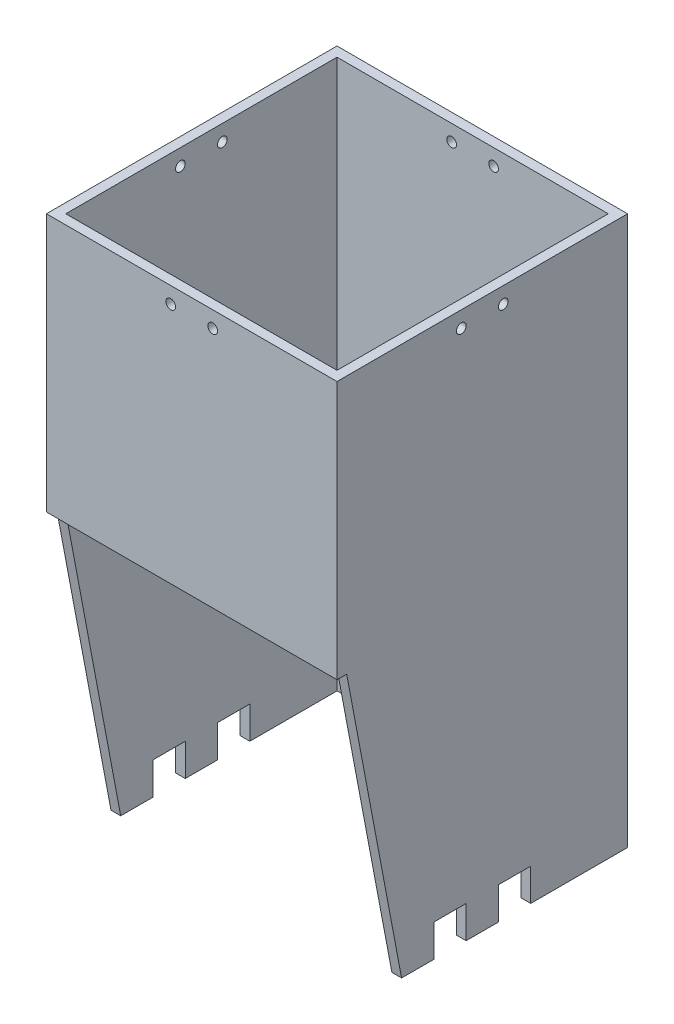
from build123d import *

# Parameters (mm, degrees)
SKETCH_1_W          = 90
SKETCH_1_H          = 90
SKETCH_1_W_2        = 84
SKETCH_1_H_2        = 84
EXTRUDE_1_DEPTH     = 170
CUT_EXTRUDE_1_REACH = 199.547
SKETCH_2_R          = 1.5
CUT_EXTRUDE_2_REACH = 199.547
SKETCH_3_R          = 1.5
CUT_EXTRUDE_3_REACH = 199.547
SKETCH_4_W          = 10
SKETCH_4_H          = 10
CUT_EXTRUDE_4_REACH = 199.547


with BuildPart() as part:
    # Sketch 1 → Extrude 1 (new body)
    with BuildSketch(Plane(origin=(0, 0, 0), x_dir=(1, 0, 0), z_dir=(0, 1, 0))):
        Rectangle(SKETCH_1_W, SKETCH_1_H)
        Rectangle(SKETCH_1_W_2, SKETCH_1_H_2, mode=Mode.SUBTRACT)
    extrude(amount=EXTRUDE_1_DEPTH)

    # Cut-Extrude 1: up to this face of the body (flat: up to its plane)
    cut_extrude_1_end = Plane(part.part.faces().sort_by_distance((0, 85, -45))[0])
    # Sketch 2 → Cut-Extrude 1 (cut, up to the picked face)
    with BuildSketch(Plane.XY.offset(45), mode=Mode.PRIVATE) as cut_extrude_1_sk1:
        with Locations((6.5, 165)):
            Circle(SKETCH_2_R)
    cut_extrude_1_tool1 = split(extrude(cut_extrude_1_sk1.sketch, amount=-CUT_EXTRUDE_1_REACH, mode=Mode.PRIVATE), bisect_by=cut_extrude_1_end, keep=Keep.BOTH, mode=Mode.PRIVATE)
    # Sketch 2 → Cut-Extrude 1 (cut, up to the picked face)
    with BuildSketch(Plane.XY.offset(45), mode=Mode.PRIVATE) as cut_extrude_1_sk2:
        with Locations((-6.5, 165)):
            Circle(SKETCH_2_R)
    cut_extrude_1_tool2 = split(extrude(cut_extrude_1_sk2.sketch, amount=-CUT_EXTRUDE_1_REACH, mode=Mode.PRIVATE), bisect_by=cut_extrude_1_end, keep=Keep.BOTH, mode=Mode.PRIVATE)
    add(cut_extrude_1_tool1.solids().sort_by(Axis((6.5, 165, 45), (0, 0, -1)))[0], mode=Mode.SUBTRACT)
    add(cut_extrude_1_tool2.solids().sort_by(Axis((-6.5, 165, 45), (0, 0, -1)))[0], mode=Mode.SUBTRACT)

    # Cut-Extrude 2: up to this face of the body (flat: up to its plane)
    cut_extrude_2_end = Plane(part.part.faces().sort_by_distance((-45, 85, 0))[0])
    # Sketch 3 → Cut-Extrude 2 (cut, up to the picked face)
    with BuildSketch(Plane(origin=(45, 0, 0), x_dir=(0, 0, -1), z_dir=(1, 0, 0)), mode=Mode.PRIVATE) as cut_extrude_2_sk1:
        with Locations((6.5, 165)):
            Circle(SKETCH_3_R)
    cut_extrude_2_tool1 = split(extrude(cut_extrude_2_sk1.sketch, amount=-CUT_EXTRUDE_2_REACH, mode=Mode.PRIVATE), bisect_by=cut_extrude_2_end, keep=Keep.BOTH, mode=Mode.PRIVATE)
    # Sketch 3 → Cut-Extrude 2 (cut, up to the picked face)
    with BuildSketch(Plane(origin=(45, 0, 0), x_dir=(0, 0, -1), z_dir=(1, 0, 0)), mode=Mode.PRIVATE) as cut_extrude_2_sk2:
        with Locations((-6.5, 165)):
            Circle(SKETCH_3_R)
    cut_extrude_2_tool2 = split(extrude(cut_extrude_2_sk2.sketch, amount=-CUT_EXTRUDE_2_REACH, mode=Mode.PRIVATE), bisect_by=cut_extrude_2_end, keep=Keep.BOTH, mode=Mode.PRIVATE)
    add(cut_extrude_2_tool1.solids().sort_by(Axis((45, 165, -6.5), (-1, 0, 0)))[0], mode=Mode.SUBTRACT)
    add(cut_extrude_2_tool2.solids().sort_by(Axis((45, 165, 6.5), (-1, 0, 0)))[0], mode=Mode.SUBTRACT)

    # Cut-Extrude 3: up to this face of the body (flat: up to its plane)
    cut_extrude_3_end = Plane(part.part.faces().sort_by_distance((-45, 84.926011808, 0))[0])
    # Sketch 4 → Cut-Extrude 3 (cut, up to the picked face)
    with BuildSketch(Plane(origin=(45, 0, 0), x_dir=(0, 0, -1), z_dir=(1, 0, 0)), mode=Mode.PRIVATE) as cut_extrude_3_sk1:
        with Locations((10, 5)):
            Rectangle(SKETCH_4_W, SKETCH_4_H)
    cut_extrude_3_tool1 = split(extrude(cut_extrude_3_sk1.sketch, amount=-CUT_EXTRUDE_3_REACH, mode=Mode.PRIVATE), bisect_by=cut_extrude_3_end, keep=Keep.BOTH, mode=Mode.PRIVATE)
    # Sketch 4 → Cut-Extrude 3 (cut, up to the picked face)
    with BuildSketch(Plane(origin=(45, 0, 0), x_dir=(0, 0, -1), z_dir=(1, 0, 0)), mode=Mode.PRIVATE) as cut_extrude_3_sk2:
        with Locations((-10, 5)):
            Rectangle(SKETCH_4_W, SKETCH_4_H)
    cut_extrude_3_tool2 = split(extrude(cut_extrude_3_sk2.sketch, amount=-CUT_EXTRUDE_3_REACH, mode=Mode.PRIVATE), bisect_by=cut_extrude_3_end, keep=Keep.BOTH, mode=Mode.PRIVATE)
    add(cut_extrude_3_tool1.solids().sort_by(Axis((45, 5, -10), (-1, 0, 0)))[0], mode=Mode.SUBTRACT)
    add(cut_extrude_3_tool2.solids().sort_by(Axis((45, 5, 10), (-1, 0, 0)))[0], mode=Mode.SUBTRACT)

    # Cut-Extrude 4: up to this face of the body (flat: up to its plane)
    cut_extrude_4_end = Plane(part.part.faces().sort_by_distance((-45, 85.985626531, 0))[0])
    # Sketch 5 → Cut-Extrude 4 (cut, up to the picked face)
    with BuildSketch(Plane(origin=(45, 0, 0), x_dir=(0, 0, -1), z_dir=(1, 0, 0)), mode=Mode.PRIVATE) as cut_extrude_4_sk1:
        Polygon((-25, 0), (-45, 0), (-45, 90), (-42, 90), align=None)
    cut_extrude_4_tool1 = split(extrude(cut_extrude_4_sk1.sketch, amount=-CUT_EXTRUDE_4_REACH, mode=Mode.PRIVATE), bisect_by=cut_extrude_4_end, keep=Keep.BOTH, mode=Mode.PRIVATE)
    add(cut_extrude_4_tool1.solids().sort_by(Axis((45, 33.913043, 38.202899), (-1, 0, 0)))[0], mode=Mode.SUBTRACT)


solid = part.part
